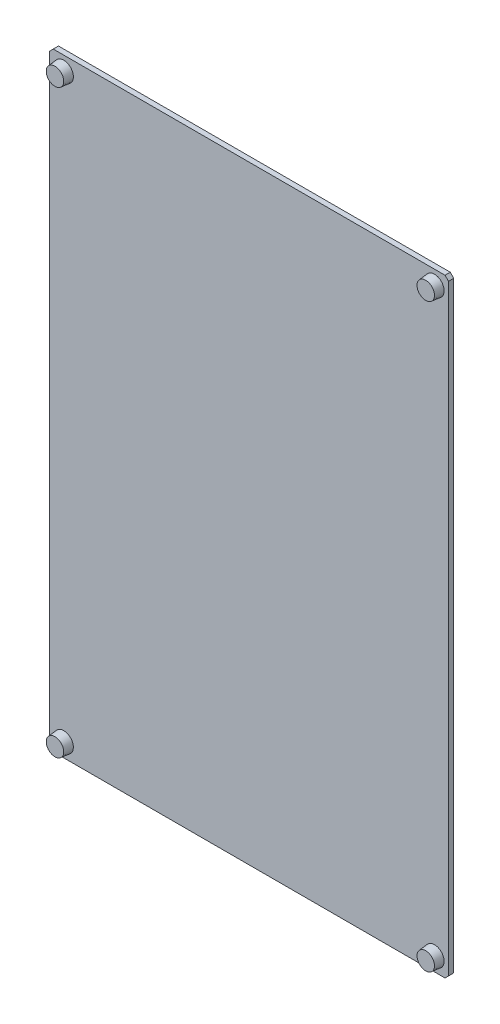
ISO-10303-21;
HEADER;
FILE_DESCRIPTION(('STEP AP214'),'2;1');
FILE_NAME('part.step','',(''),(''),'','','');
FILE_SCHEMA(('AUTOMOTIVE_DESIGN { 1 0 10303 214 1 1 1 1 }'));
ENDSEC;
DATA;
#1=APPLICATION_CONTEXT('core data for automotive mechanical design processes');
#2=APPLICATION_PROTOCOL_DEFINITION('international standard','automotive_design',2000,#1);
#3=PRODUCT_CONTEXT('',#1,'mechanical');
#4=PRODUCT('Part','Part','',(#3));
#5=PRODUCT_RELATED_PRODUCT_CATEGORY('part','',(#4));
#6=PRODUCT_DEFINITION_FORMATION('','',#4);
#7=PRODUCT_DEFINITION_CONTEXT('part definition',#1,'design');
#8=PRODUCT_DEFINITION('design','',#6,#7);
#9=PRODUCT_DEFINITION_SHAPE('','',#8);
#10=(LENGTH_UNIT() NAMED_UNIT(*) SI_UNIT(.MILLI.,.METRE.));
#11=(NAMED_UNIT(*) PLANE_ANGLE_UNIT() SI_UNIT($,.RADIAN.));
#12=(NAMED_UNIT(*) SI_UNIT($,.STERADIAN.) SOLID_ANGLE_UNIT());
#13=UNCERTAINTY_MEASURE_WITH_UNIT(LENGTH_MEASURE(1.E-05),#10,'distance_accuracy_value','');
#14=(GEOMETRIC_REPRESENTATION_CONTEXT(3) GLOBAL_UNCERTAINTY_ASSIGNED_CONTEXT((#13)) GLOBAL_UNIT_ASSIGNED_CONTEXT((#10,
#11,#12)) REPRESENTATION_CONTEXT('',''));
#15=CARTESIAN_POINT('',(0.,0.,0.));
#16=DIRECTION('',(0.,0.,1.));
#17=DIRECTION('',(1.,0.,0.));
#18=AXIS2_PLACEMENT_3D('',#15,#16,#17);
#19=CARTESIAN_POINT('',(-114.,174.,3.));
#20=DIRECTION('',(1.,0.,0.));
#21=DIRECTION('',(0.,1.,0.));
#22=AXIS2_PLACEMENT_3D('',#19,#20,#21);
#23=PLANE('',#22);
#24=DIRECTION('',(0.,-1.,0.));
#25=VECTOR('',#24,1.);
#26=CARTESIAN_POINT('',(-114.,174.,0.));
#27=LINE('',#26,#25);
#28=CARTESIAN_POINT('',(-114.,172.,0.));
#29=VERTEX_POINT('',#28);
#30=CARTESIAN_POINT('',(-114.,-172.,0.));
#31=VERTEX_POINT('',#30);
#32=EDGE_CURVE('E110',#29,#31,#27,.T.);
#33=ORIENTED_EDGE('',*,*,#32,.T.);
#34=DIRECTION('',(0.,0.,1.));
#35=VECTOR('',#34,1.);
#36=CARTESIAN_POINT('',(-114.,-172.,3.));
#37=LINE('',#36,#35);
#38=CARTESIAN_POINT('',(-114.,-172.,3.));
#39=VERTEX_POINT('',#38);
#40=EDGE_CURVE('E88',#31,#39,#37,.T.);
#41=ORIENTED_EDGE('',*,*,#40,.T.);
#42=DIRECTION('',(0.,-1.,0.));
#43=VECTOR('',#42,1.);
#44=CARTESIAN_POINT('',(-114.,174.,3.));
#45=LINE('',#44,#43);
#46=CARTESIAN_POINT('',(-114.,172.,3.));
#47=VERTEX_POINT('',#46);
#48=EDGE_CURVE('E120',#47,#39,#45,.T.);
#49=ORIENTED_EDGE('',*,*,#48,.F.);
#50=DIRECTION('',(0.,0.,-1.));
#51=VECTOR('',#50,1.);
#52=CARTESIAN_POINT('',(-114.,172.,3.));
#53=LINE('',#52,#51);
#54=EDGE_CURVE('E93',#47,#29,#53,.T.);
#55=ORIENTED_EDGE('',*,*,#54,.T.);
#56=EDGE_LOOP('',(#33,#41,#49,#55));
#57=FACE_BOUND('',#56,.T.);
#58=ADVANCED_FACE('F16',(#57),#23,.F.);
#59=CARTESIAN_POINT('',(-114.,-174.,3.));
#60=DIRECTION('',(0.,1.,0.));
#61=DIRECTION('',(0.,0.,1.));
#62=AXIS2_PLACEMENT_3D('',#59,#60,#61);
#63=PLANE('',#62);
#64=DIRECTION('',(1.,0.,0.));
#65=VECTOR('',#64,1.);
#66=CARTESIAN_POINT('',(-114.,-174.,3.));
#67=LINE('',#66,#65);
#68=CARTESIAN_POINT('',(-112.,-174.,3.));
#69=VERTEX_POINT('',#68);
#70=CARTESIAN_POINT('',(112.,-174.,3.));
#71=VERTEX_POINT('',#70);
#72=EDGE_CURVE('E103',#69,#71,#67,.T.);
#73=ORIENTED_EDGE('',*,*,#72,.F.);
#74=DIRECTION('',(0.,0.,-1.));
#75=VECTOR('',#74,1.);
#76=CARTESIAN_POINT('',(-112.,-174.,3.));
#77=LINE('',#76,#75);
#78=CARTESIAN_POINT('',(-112.,-174.,0.));
#79=VERTEX_POINT('',#78);
#80=EDGE_CURVE('E87',#69,#79,#77,.T.);
#81=ORIENTED_EDGE('',*,*,#80,.T.);
#82=DIRECTION('',(1.,0.,0.));
#83=VECTOR('',#82,1.);
#84=CARTESIAN_POINT('',(-114.,-174.,0.));
#85=LINE('',#84,#83);
#86=CARTESIAN_POINT('',(112.,-174.,0.));
#87=VERTEX_POINT('',#86);
#88=EDGE_CURVE('E100',#79,#87,#85,.T.);
#89=ORIENTED_EDGE('',*,*,#88,.T.);
#90=DIRECTION('',(0.,0.,1.));
#91=VECTOR('',#90,1.);
#92=CARTESIAN_POINT('',(112.,-174.,3.));
#93=LINE('',#92,#91);
#94=EDGE_CURVE('E105',#87,#71,#93,.T.);
#95=ORIENTED_EDGE('',*,*,#94,.T.);
#96=EDGE_LOOP('',(#73,#81,#89,#95));
#97=FACE_BOUND('',#96,.T.);
#98=ADVANCED_FACE('F99',(#97),#63,.F.);
#99=CARTESIAN_POINT('',(114.,174.,3.));
#100=DIRECTION('',(-1.,0.,0.));
#101=DIRECTION('',(0.,-1.,0.));
#102=AXIS2_PLACEMENT_3D('',#99,#100,#101);
#103=PLANE('',#102);
#104=DIRECTION('',(0.,1.,0.));
#105=VECTOR('',#104,1.);
#106=CARTESIAN_POINT('',(114.,174.,3.));
#107=LINE('',#106,#105);
#108=CARTESIAN_POINT('',(114.,-172.,3.));
#109=VERTEX_POINT('',#108);
#110=CARTESIAN_POINT('',(114.,172.,3.));
#111=VERTEX_POINT('',#110);
#112=EDGE_CURVE('E172',#109,#111,#107,.T.);
#113=ORIENTED_EDGE('',*,*,#112,.F.);
#114=DIRECTION('',(0.,0.,-1.));
#115=VECTOR('',#114,1.);
#116=CARTESIAN_POINT('',(114.,-172.,3.));
#117=LINE('',#116,#115);
#118=CARTESIAN_POINT('',(114.,-172.,0.));
#119=VERTEX_POINT('',#118);
#120=EDGE_CURVE('E139',#109,#119,#117,.T.);
#121=ORIENTED_EDGE('',*,*,#120,.T.);
#122=DIRECTION('',(0.,1.,0.));
#123=VECTOR('',#122,1.);
#124=CARTESIAN_POINT('',(114.,174.,0.));
#125=LINE('',#124,#123);
#126=CARTESIAN_POINT('',(114.,172.,0.));
#127=VERTEX_POINT('',#126);
#128=EDGE_CURVE('E109',#119,#127,#125,.T.);
#129=ORIENTED_EDGE('',*,*,#128,.T.);
#130=DIRECTION('',(0.,0.,1.));
#131=VECTOR('',#130,1.);
#132=CARTESIAN_POINT('',(114.,172.,3.));
#133=LINE('',#132,#131);
#134=EDGE_CURVE('E137',#127,#111,#133,.T.);
#135=ORIENTED_EDGE('',*,*,#134,.T.);
#136=EDGE_LOOP('',(#113,#121,#129,#135));
#137=FACE_BOUND('',#136,.T.);
#138=ADVANCED_FACE('F185',(#137),#103,.F.);
#139=CARTESIAN_POINT('',(-114.,174.,3.));
#140=DIRECTION('',(0.,-1.,0.));
#141=DIRECTION('',(0.,0.,-1.));
#142=AXIS2_PLACEMENT_3D('',#139,#140,#141);
#143=PLANE('',#142);
#144=DIRECTION('',(-1.,0.,0.));
#145=VECTOR('',#144,1.);
#146=CARTESIAN_POINT('',(-114.,174.,0.));
#147=LINE('',#146,#145);
#148=CARTESIAN_POINT('',(112.,174.,0.));
#149=VERTEX_POINT('',#148);
#150=CARTESIAN_POINT('',(-112.,174.,0.));
#151=VERTEX_POINT('',#150);
#152=EDGE_CURVE('E113',#149,#151,#147,.T.);
#153=ORIENTED_EDGE('',*,*,#152,.T.);
#154=DIRECTION('',(0.,0.,1.));
#155=VECTOR('',#154,1.);
#156=CARTESIAN_POINT('',(-112.,174.,3.));
#157=LINE('',#156,#155);
#158=CARTESIAN_POINT('',(-112.,174.,3.));
#159=VERTEX_POINT('',#158);
#160=EDGE_CURVE('E31',#151,#159,#157,.T.);
#161=ORIENTED_EDGE('',*,*,#160,.T.);
#162=DIRECTION('',(-1.,0.,0.));
#163=VECTOR('',#162,1.);
#164=CARTESIAN_POINT('',(-114.,174.,3.));
#165=LINE('',#164,#163);
#166=CARTESIAN_POINT('',(112.,174.,3.));
#167=VERTEX_POINT('',#166);
#168=EDGE_CURVE('E121',#167,#159,#165,.T.);
#169=ORIENTED_EDGE('',*,*,#168,.F.);
#170=DIRECTION('',(0.,0.,-1.));
#171=VECTOR('',#170,1.);
#172=CARTESIAN_POINT('',(112.,174.,3.));
#173=LINE('',#172,#171);
#174=EDGE_CURVE('E142',#167,#149,#173,.T.);
#175=ORIENTED_EDGE('',*,*,#174,.T.);
#176=EDGE_LOOP('',(#153,#161,#169,#175));
#177=FACE_BOUND('',#176,.T.);
#178=ADVANCED_FACE('F160',(#177),#143,.F.);
#179=CARTESIAN_POINT('',(-114.,-174.,3.));
#180=DIRECTION('',(0.,0.,1.));
#181=DIRECTION('',(1.,0.,0.));
#182=AXIS2_PLACEMENT_3D('',#179,#180,#181);
#183=PLANE('',#182);
#184=CARTESIAN_POINT('',(-106.,-166.,3.));
#185=DIRECTION('',(0.,0.,1.));
#186=DIRECTION('',(1.,0.,0.));
#187=AXIS2_PLACEMENT_3D('',#184,#185,#186);
#188=CIRCLE('',#187,5.5);
#189=CARTESIAN_POINT('',(-100.5,-166.,3.));
#190=VERTEX_POINT('',#189);
#191=EDGE_CURVE('E10',#190,#190,#188,.T.);
#192=ORIENTED_EDGE('',*,*,#191,.F.);
#193=EDGE_LOOP('',(#192));
#194=FACE_BOUND('',#193,.T.);
#195=CARTESIAN_POINT('',(106.,-166.,3.));
#196=DIRECTION('',(0.,0.,1.));
#197=DIRECTION('',(1.,0.,0.));
#198=AXIS2_PLACEMENT_3D('',#195,#196,#197);
#199=CIRCLE('',#198,5.5);
#200=CARTESIAN_POINT('',(111.5,-166.,3.));
#201=VERTEX_POINT('',#200);
#202=EDGE_CURVE('E24',#201,#201,#199,.T.);
#203=ORIENTED_EDGE('',*,*,#202,.F.);
#204=EDGE_LOOP('',(#203));
#205=FACE_BOUND('',#204,.T.);
#206=CARTESIAN_POINT('',(-106.,166.,3.));
#207=DIRECTION('',(0.,0.,1.));
#208=DIRECTION('',(1.,0.,0.));
#209=AXIS2_PLACEMENT_3D('',#206,#207,#208);
#210=CIRCLE('',#209,5.5);
#211=CARTESIAN_POINT('',(-100.5,166.,3.));
#212=VERTEX_POINT('',#211);
#213=EDGE_CURVE('E149',#212,#212,#210,.T.);
#214=ORIENTED_EDGE('',*,*,#213,.F.);
#215=EDGE_LOOP('',(#214));
#216=FACE_BOUND('',#215,.T.);
#217=CARTESIAN_POINT('',(106.,166.,3.));
#218=DIRECTION('',(0.,0.,1.));
#219=DIRECTION('',(1.,0.,0.));
#220=AXIS2_PLACEMENT_3D('',#217,#218,#219);
#221=CIRCLE('',#220,5.5);
#222=CARTESIAN_POINT('',(111.5,166.,3.));
#223=VERTEX_POINT('',#222);
#224=EDGE_CURVE('E146',#223,#223,#221,.T.);
#225=ORIENTED_EDGE('',*,*,#224,.F.);
#226=EDGE_LOOP('',(#225));
#227=FACE_BOUND('',#226,.T.);
#228=ORIENTED_EDGE('',*,*,#48,.T.);
#229=DIRECTION('',(-0.707106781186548,0.707106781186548,0.));
#230=VECTOR('',#229,1.);
#231=CARTESIAN_POINT('',(-113.,-173.,3.));
#232=LINE('',#231,#230);
#233=EDGE_CURVE('E135',#39,#69,#232,.F.);
#234=ORIENTED_EDGE('',*,*,#233,.T.);
#235=ORIENTED_EDGE('',*,*,#72,.T.);
#236=DIRECTION('',(-0.707106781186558,-0.707106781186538,0.));
#237=VECTOR('',#236,1.);
#238=CARTESIAN_POINT('',(-1.00000000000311,-287.,3.));
#239=LINE('',#238,#237);
#240=EDGE_CURVE('E133',#71,#109,#239,.F.);
#241=ORIENTED_EDGE('',*,*,#240,.T.);
#242=ORIENTED_EDGE('',*,*,#112,.T.);
#243=DIRECTION('',(0.707106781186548,-0.707106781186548,0.));
#244=VECTOR('',#243,1.);
#245=CARTESIAN_POINT('',(173.,113.,3.));
#246=LINE('',#245,#244);
#247=EDGE_CURVE('E38',#111,#167,#246,.F.);
#248=ORIENTED_EDGE('',*,*,#247,.T.);
#249=ORIENTED_EDGE('',*,*,#168,.T.);
#250=DIRECTION('',(0.707106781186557,0.707106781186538,0.));
#251=VECTOR('',#250,1.);
#252=CARTESIAN_POINT('',(-287.,-0.999999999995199,3.));
#253=LINE('',#252,#251);
#254=EDGE_CURVE('E131',#159,#47,#253,.F.);
#255=ORIENTED_EDGE('',*,*,#254,.T.);
#256=EDGE_LOOP('',(#228,#234,#235,#241,#242,#248,#249,#255));
#257=FACE_BOUND('',#256,.T.);
#258=ADVANCED_FACE('F157',(#194,#205,#216,#227,#257),#183,.T.);
#259=CARTESIAN_POINT('',(-114.,-174.,0.));
#260=DIRECTION('',(0.,0.,1.));
#261=DIRECTION('',(1.,0.,0.));
#262=AXIS2_PLACEMENT_3D('',#259,#260,#261);
#263=PLANE('',#262);
#264=ORIENTED_EDGE('',*,*,#88,.F.);
#265=DIRECTION('',(0.707106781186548,-0.707106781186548,0.));
#266=VECTOR('',#265,1.);
#267=CARTESIAN_POINT('',(-112.,-174.,0.));
#268=LINE('',#267,#266);
#269=EDGE_CURVE('E83',#79,#31,#268,.F.);
#270=ORIENTED_EDGE('',*,*,#269,.T.);
#271=ORIENTED_EDGE('',*,*,#32,.F.);
#272=DIRECTION('',(-0.707106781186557,-0.707106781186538,0.));
#273=VECTOR('',#272,1.);
#274=CARTESIAN_POINT('',(-114.,172.,0.));
#275=LINE('',#274,#273);
#276=EDGE_CURVE('E124',#29,#151,#275,.F.);
#277=ORIENTED_EDGE('',*,*,#276,.T.);
#278=ORIENTED_EDGE('',*,*,#152,.F.);
#279=DIRECTION('',(-0.707106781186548,0.707106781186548,0.));
#280=VECTOR('',#279,1.);
#281=CARTESIAN_POINT('',(112.,174.,0.));
#282=LINE('',#281,#280);
#283=EDGE_CURVE('E104',#149,#127,#282,.F.);
#284=ORIENTED_EDGE('',*,*,#283,.T.);
#285=ORIENTED_EDGE('',*,*,#128,.F.);
#286=DIRECTION('',(0.707106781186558,0.707106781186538,0.));
#287=VECTOR('',#286,1.);
#288=CARTESIAN_POINT('',(114.,-172.,0.));
#289=LINE('',#288,#287);
#290=EDGE_CURVE('E94',#119,#87,#289,.F.);
#291=ORIENTED_EDGE('',*,*,#290,.T.);
#292=EDGE_LOOP('',(#264,#270,#271,#277,#278,#284,#285,#291));
#293=FACE_BOUND('',#292,.T.);
#294=ADVANCED_FACE('F107',(#293),#263,.F.);
#295=CARTESIAN_POINT('',(-112.,-174.,3.));
#296=DIRECTION('',(0.707106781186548,0.707106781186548,0.));
#297=DIRECTION('',(-0.707106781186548,0.707106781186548,0.));
#298=AXIS2_PLACEMENT_3D('',#295,#296,#297);
#299=PLANE('',#298);
#300=ORIENTED_EDGE('',*,*,#233,.F.);
#301=ORIENTED_EDGE('',*,*,#40,.F.);
#302=ORIENTED_EDGE('',*,*,#269,.F.);
#303=ORIENTED_EDGE('',*,*,#80,.F.);
#304=EDGE_LOOP('',(#300,#301,#302,#303));
#305=FACE_BOUND('',#304,.T.);
#306=ADVANCED_FACE('F86',(#305),#299,.F.);
#307=CARTESIAN_POINT('',(114.,-172.,3.));
#308=DIRECTION('',(-0.707106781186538,0.707106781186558,0.));
#309=DIRECTION('',(-0.707106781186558,-0.707106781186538,0.));
#310=AXIS2_PLACEMENT_3D('',#307,#308,#309);
#311=PLANE('',#310);
#312=ORIENTED_EDGE('',*,*,#240,.F.);
#313=ORIENTED_EDGE('',*,*,#94,.F.);
#314=ORIENTED_EDGE('',*,*,#290,.F.);
#315=ORIENTED_EDGE('',*,*,#120,.F.);
#316=EDGE_LOOP('',(#312,#313,#314,#315));
#317=FACE_BOUND('',#316,.T.);
#318=ADVANCED_FACE('F189',(#317),#311,.F.);
#319=CARTESIAN_POINT('',(-114.,172.,3.));
#320=DIRECTION('',(0.707106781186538,-0.707106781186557,0.));
#321=DIRECTION('',(0.707106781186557,0.707106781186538,0.));
#322=AXIS2_PLACEMENT_3D('',#319,#320,#321);
#323=PLANE('',#322);
#324=ORIENTED_EDGE('',*,*,#254,.F.);
#325=ORIENTED_EDGE('',*,*,#160,.F.);
#326=ORIENTED_EDGE('',*,*,#276,.F.);
#327=ORIENTED_EDGE('',*,*,#54,.F.);
#328=EDGE_LOOP('',(#324,#325,#326,#327));
#329=FACE_BOUND('',#328,.T.);
#330=ADVANCED_FACE('F179',(#329),#323,.F.);
#331=CARTESIAN_POINT('',(112.,174.,3.));
#332=DIRECTION('',(-0.707106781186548,-0.707106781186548,0.));
#333=DIRECTION('',(0.707106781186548,-0.707106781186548,0.));
#334=AXIS2_PLACEMENT_3D('',#331,#332,#333);
#335=PLANE('',#334);
#336=ORIENTED_EDGE('',*,*,#247,.F.);
#337=ORIENTED_EDGE('',*,*,#134,.F.);
#338=ORIENTED_EDGE('',*,*,#283,.F.);
#339=ORIENTED_EDGE('',*,*,#174,.F.);
#340=EDGE_LOOP('',(#336,#337,#338,#339));
#341=FACE_BOUND('',#340,.T.);
#342=ADVANCED_FACE('F18',(#341),#335,.F.);
#343=CARTESIAN_POINT('',(106.,166.,8.));
#344=DIRECTION('',(0.,0.,-1.));
#345=DIRECTION('',(-1.,0.,0.));
#346=AXIS2_PLACEMENT_3D('',#343,#344,#345);
#347=CONICAL_SURFACE('',#346,5.,0.0996686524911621);
#348=ORIENTED_EDGE('',*,*,#224,.T.);
#349=EDGE_LOOP('',(#348));
#350=FACE_BOUND('',#349,.T.);
#351=CARTESIAN_POINT('',(106.,166.,8.));
#352=DIRECTION('',(0.,0.,1.));
#353=DIRECTION('',(1.,0.,0.));
#354=AXIS2_PLACEMENT_3D('',#351,#352,#353);
#355=CIRCLE('',#354,5.);
#356=CARTESIAN_POINT('',(111.,166.,8.));
#357=VERTEX_POINT('',#356);
#358=EDGE_CURVE('E115',#357,#357,#355,.T.);
#359=ORIENTED_EDGE('',*,*,#358,.F.);
#360=EDGE_LOOP('',(#359));
#361=FACE_BOUND('',#360,.T.);
#362=ADVANCED_FACE('F213',(#350,#361),#347,.T.);
#363=CARTESIAN_POINT('',(111.,166.,8.));
#364=DIRECTION('',(0.,0.,1.));
#365=DIRECTION('',(1.,0.,0.));
#366=AXIS2_PLACEMENT_3D('',#363,#364,#365);
#367=PLANE('',#366);
#368=ORIENTED_EDGE('',*,*,#358,.T.);
#369=EDGE_LOOP('',(#368));
#370=FACE_BOUND('',#369,.T.);
#371=ADVANCED_FACE('F216',(#370),#367,.T.);
#372=CARTESIAN_POINT('',(-106.,166.,8.));
#373=DIRECTION('',(0.,0.,-1.));
#374=DIRECTION('',(-1.,0.,0.));
#375=AXIS2_PLACEMENT_3D('',#372,#373,#374);
#376=CONICAL_SURFACE('',#375,5.,0.0996686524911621);
#377=ORIENTED_EDGE('',*,*,#213,.T.);
#378=EDGE_LOOP('',(#377));
#379=FACE_BOUND('',#378,.T.);
#380=CARTESIAN_POINT('',(-106.,166.,8.));
#381=DIRECTION('',(0.,0.,1.));
#382=DIRECTION('',(1.,0.,0.));
#383=AXIS2_PLACEMENT_3D('',#380,#381,#382);
#384=CIRCLE('',#383,5.);
#385=CARTESIAN_POINT('',(-101.,166.,8.));
#386=VERTEX_POINT('',#385);
#387=EDGE_CURVE('E252',#386,#386,#384,.T.);
#388=ORIENTED_EDGE('',*,*,#387,.F.);
#389=EDGE_LOOP('',(#388));
#390=FACE_BOUND('',#389,.T.);
#391=ADVANCED_FACE('F220',(#379,#390),#376,.T.);
#392=CARTESIAN_POINT('',(-101.,166.,8.));
#393=DIRECTION('',(0.,0.,1.));
#394=DIRECTION('',(1.,0.,0.));
#395=AXIS2_PLACEMENT_3D('',#392,#393,#394);
#396=PLANE('',#395);
#397=ORIENTED_EDGE('',*,*,#387,.T.);
#398=EDGE_LOOP('',(#397));
#399=FACE_BOUND('',#398,.T.);
#400=ADVANCED_FACE('F224',(#399),#396,.T.);
#401=CARTESIAN_POINT('',(106.,-166.,8.));
#402=DIRECTION('',(0.,0.,-1.));
#403=DIRECTION('',(-1.,0.,0.));
#404=AXIS2_PLACEMENT_3D('',#401,#402,#403);
#405=CONICAL_SURFACE('',#404,5.,0.0996686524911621);
#406=ORIENTED_EDGE('',*,*,#202,.T.);
#407=EDGE_LOOP('',(#406));
#408=FACE_BOUND('',#407,.T.);
#409=CARTESIAN_POINT('',(106.,-166.,8.));
#410=DIRECTION('',(0.,0.,1.));
#411=DIRECTION('',(1.,0.,0.));
#412=AXIS2_PLACEMENT_3D('',#409,#410,#411);
#413=CIRCLE('',#412,5.);
#414=CARTESIAN_POINT('',(111.,-166.,8.));
#415=VERTEX_POINT('',#414);
#416=EDGE_CURVE('E249',#415,#415,#413,.T.);
#417=ORIENTED_EDGE('',*,*,#416,.F.);
#418=EDGE_LOOP('',(#417));
#419=FACE_BOUND('',#418,.T.);
#420=ADVANCED_FACE('F154',(#408,#419),#405,.T.);
#421=CARTESIAN_POINT('',(111.,-166.,8.));
#422=DIRECTION('',(0.,0.,1.));
#423=DIRECTION('',(1.,0.,0.));
#424=AXIS2_PLACEMENT_3D('',#421,#422,#423);
#425=PLANE('',#424);
#426=ORIENTED_EDGE('',*,*,#416,.T.);
#427=EDGE_LOOP('',(#426));
#428=FACE_BOUND('',#427,.T.);
#429=ADVANCED_FACE('F231',(#428),#425,.T.);
#430=CARTESIAN_POINT('',(-106.,-166.,8.));
#431=DIRECTION('',(0.,0.,-1.));
#432=DIRECTION('',(-1.,0.,0.));
#433=AXIS2_PLACEMENT_3D('',#430,#431,#432);
#434=CONICAL_SURFACE('',#433,5.,0.0996686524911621);
#435=ORIENTED_EDGE('',*,*,#191,.T.);
#436=EDGE_LOOP('',(#435));
#437=FACE_BOUND('',#436,.T.);
#438=CARTESIAN_POINT('',(-106.,-166.,8.));
#439=DIRECTION('',(0.,0.,1.));
#440=DIRECTION('',(1.,0.,0.));
#441=AXIS2_PLACEMENT_3D('',#438,#439,#440);
#442=CIRCLE('',#441,5.);
#443=CARTESIAN_POINT('',(-101.,-166.,8.));
#444=VERTEX_POINT('',#443);
#445=EDGE_CURVE('E247',#444,#444,#442,.T.);
#446=ORIENTED_EDGE('',*,*,#445,.F.);
#447=EDGE_LOOP('',(#446));
#448=FACE_BOUND('',#447,.T.);
#449=ADVANCED_FACE('F234',(#437,#448),#434,.T.);
#450=CARTESIAN_POINT('',(-101.,-166.,8.));
#451=DIRECTION('',(0.,0.,1.));
#452=DIRECTION('',(1.,0.,0.));
#453=AXIS2_PLACEMENT_3D('',#450,#451,#452);
#454=PLANE('',#453);
#455=ORIENTED_EDGE('',*,*,#445,.T.);
#456=EDGE_LOOP('',(#455));
#457=FACE_BOUND('',#456,.T.);
#458=ADVANCED_FACE('F238',(#457),#454,.T.);
#459=CLOSED_SHELL('',(#58,#98,#138,#178,#258,#294,#306,#318,#330,#342,#362,#371,#391,#400,#420,
#429,#449,#458));
#460=MANIFOLD_SOLID_BREP('B1',#459);
#461=ADVANCED_BREP_SHAPE_REPRESENTATION('',(#18,#460),#14);
#462=SHAPE_DEFINITION_REPRESENTATION(#9,#461);
ENDSEC;
END-ISO-10303-21;
